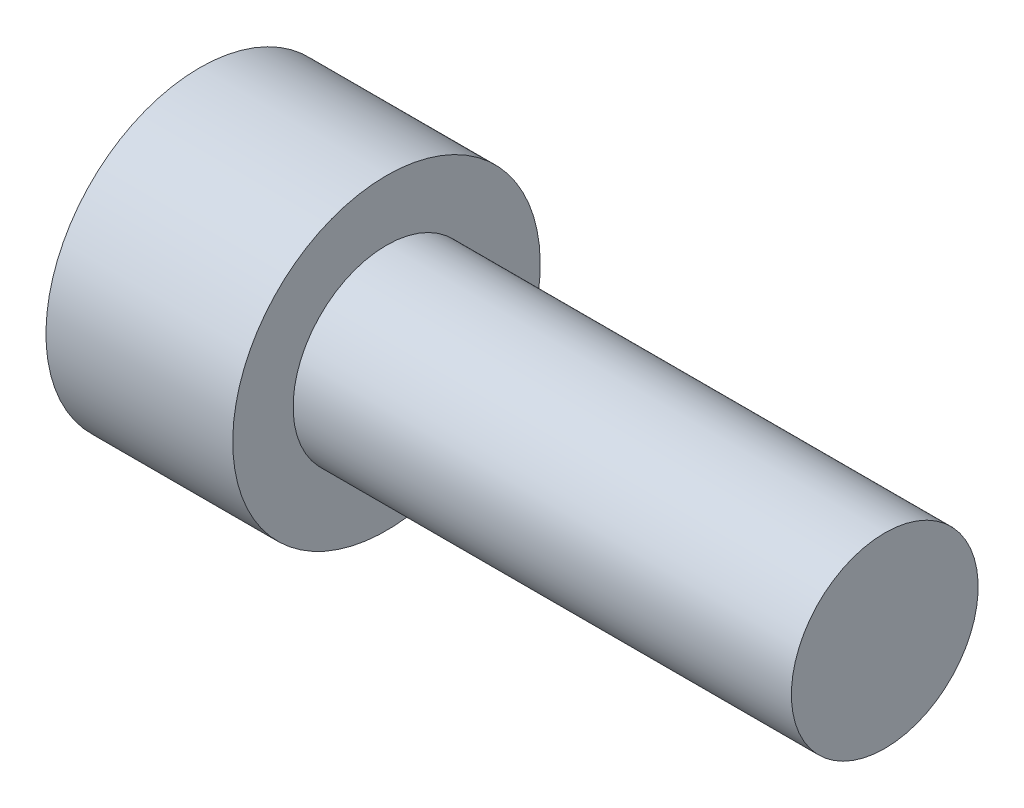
from build123d import *

# Parameters (mm, degrees)
CUT_EXTRUDE1_DEPTH = 2.54


with BuildPart() as part:
    # Sketch1 → Revolve1 (revolve)
    with BuildSketch(Plane.XY):
        Polygon((15.2781, 0), (0, 0), (0, 3.429), (4.1656, 3.429), (4.1656, 2.0828), (15.2781, 2.0828), align=None)
    revolve(axis=Axis((15.2781, 0, 0), (-1, 0, 0)))

    # Sketch2 → Cut-Extrude1 (cut)
    with BuildSketch(Plane.ZY):
        Polygon((2.062222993, 0), (1.031111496, 1.7859375), (-1.031111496, 1.7859375), (-2.062222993, 0), (-1.031111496, -1.7859375), (1.031111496, -1.7859375), align=None)
    extrude(amount=-CUT_EXTRUDE1_DEPTH, mode=Mode.SUBTRACT)


solid = part.part
